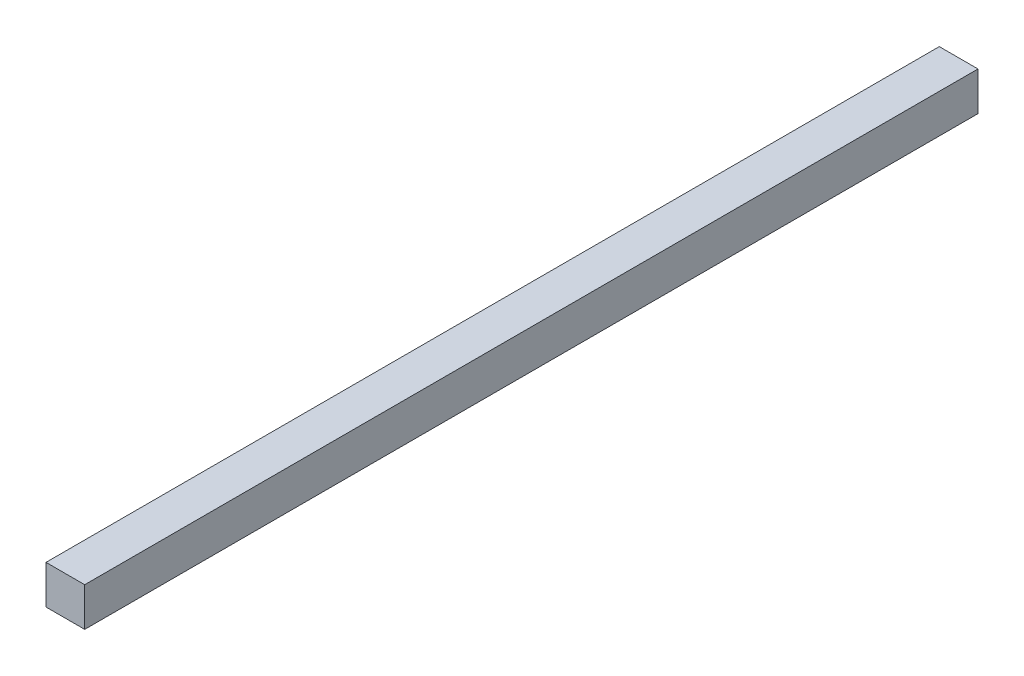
ISO-10303-21;
HEADER;
FILE_DESCRIPTION(('STEP AP214'),'2;1');
FILE_NAME('part.step','',(''),(''),'','','');
FILE_SCHEMA(('AUTOMOTIVE_DESIGN { 1 0 10303 214 1 1 1 1 }'));
ENDSEC;
DATA;
#1=APPLICATION_CONTEXT('core data for automotive mechanical design processes');
#2=APPLICATION_PROTOCOL_DEFINITION('international standard','automotive_design',2000,#1);
#3=PRODUCT_CONTEXT('',#1,'mechanical');
#4=PRODUCT('Part','Part','',(#3));
#5=PRODUCT_RELATED_PRODUCT_CATEGORY('part','',(#4));
#6=PRODUCT_DEFINITION_FORMATION('','',#4);
#7=PRODUCT_DEFINITION_CONTEXT('part definition',#1,'design');
#8=PRODUCT_DEFINITION('design','',#6,#7);
#9=PRODUCT_DEFINITION_SHAPE('','',#8);
#10=(LENGTH_UNIT() NAMED_UNIT(*) SI_UNIT(.MILLI.,.METRE.));
#11=(NAMED_UNIT(*) PLANE_ANGLE_UNIT() SI_UNIT($,.RADIAN.));
#12=(NAMED_UNIT(*) SI_UNIT($,.STERADIAN.) SOLID_ANGLE_UNIT());
#13=UNCERTAINTY_MEASURE_WITH_UNIT(LENGTH_MEASURE(1.E-05),#10,'distance_accuracy_value','');
#14=(GEOMETRIC_REPRESENTATION_CONTEXT(3) GLOBAL_UNCERTAINTY_ASSIGNED_CONTEXT((#13)) GLOBAL_UNIT_ASSIGNED_CONTEXT((#10,
#11,#12)) REPRESENTATION_CONTEXT('',''));
#15=CARTESIAN_POINT('',(0.,0.,0.));
#16=DIRECTION('',(0.,0.,1.));
#17=DIRECTION('',(1.,0.,0.));
#18=AXIS2_PLACEMENT_3D('',#15,#16,#17);
#19=CARTESIAN_POINT('',(-6.5,6.5,150.));
#20=DIRECTION('',(1.,0.,0.));
#21=DIRECTION('',(0.,0.,-1.));
#22=AXIS2_PLACEMENT_3D('',#19,#20,#21);
#23=PLANE('',#22);
#24=DIRECTION('',(0.,-1.,0.));
#25=VECTOR('',#24,1.);
#26=CARTESIAN_POINT('',(-6.5,6.5,-150.));
#27=LINE('',#26,#25);
#28=CARTESIAN_POINT('',(-6.5,6.5,-150.));
#29=VERTEX_POINT('',#28);
#30=CARTESIAN_POINT('',(-6.5,-6.5,-150.));
#31=VERTEX_POINT('',#30);
#32=EDGE_CURVE('E74',#29,#31,#27,.T.);
#33=ORIENTED_EDGE('',*,*,#32,.T.);
#34=DIRECTION('',(0.,0.,-1.));
#35=VECTOR('',#34,1.);
#36=CARTESIAN_POINT('',(-6.5,-6.5,150.));
#37=LINE('',#36,#35);
#38=CARTESIAN_POINT('',(-6.5,-6.5,150.));
#39=VERTEX_POINT('',#38);
#40=EDGE_CURVE('E11',#39,#31,#37,.T.);
#41=ORIENTED_EDGE('',*,*,#40,.F.);
#42=DIRECTION('',(0.,-1.,0.));
#43=VECTOR('',#42,1.);
#44=CARTESIAN_POINT('',(-6.5,6.5,150.));
#45=LINE('',#44,#43);
#46=CARTESIAN_POINT('',(-6.5,6.5,150.));
#47=VERTEX_POINT('',#46);
#48=EDGE_CURVE('E92',#47,#39,#45,.T.);
#49=ORIENTED_EDGE('',*,*,#48,.F.);
#50=DIRECTION('',(0.,0.,-1.));
#51=VECTOR('',#50,1.);
#52=CARTESIAN_POINT('',(-6.5,6.5,150.));
#53=LINE('',#52,#51);
#54=EDGE_CURVE('E86',#47,#29,#53,.T.);
#55=ORIENTED_EDGE('',*,*,#54,.T.);
#56=EDGE_LOOP('',(#33,#41,#49,#55));
#57=FACE_BOUND('',#56,.T.);
#58=ADVANCED_FACE('F30',(#57),#23,.F.);
#59=CARTESIAN_POINT('',(-6.5,-6.5,150.));
#60=DIRECTION('',(0.,1.,0.));
#61=DIRECTION('',(0.,0.,1.));
#62=AXIS2_PLACEMENT_3D('',#59,#60,#61);
#63=PLANE('',#62);
#64=DIRECTION('',(1.,0.,0.));
#65=VECTOR('',#64,1.);
#66=CARTESIAN_POINT('',(-6.5,-6.5,-150.));
#67=LINE('',#66,#65);
#68=CARTESIAN_POINT('',(6.5,-6.5,-150.));
#69=VERTEX_POINT('',#68);
#70=EDGE_CURVE('E70',#31,#69,#67,.T.);
#71=ORIENTED_EDGE('',*,*,#70,.T.);
#72=DIRECTION('',(0.,0.,-1.));
#73=VECTOR('',#72,1.);
#74=CARTESIAN_POINT('',(6.5,-6.5,150.));
#75=LINE('',#74,#73);
#76=CARTESIAN_POINT('',(6.5,-6.5,150.));
#77=VERTEX_POINT('',#76);
#78=EDGE_CURVE('E37',#77,#69,#75,.T.);
#79=ORIENTED_EDGE('',*,*,#78,.F.);
#80=DIRECTION('',(1.,0.,0.));
#81=VECTOR('',#80,1.);
#82=CARTESIAN_POINT('',(-6.5,-6.5,150.));
#83=LINE('',#82,#81);
#84=EDGE_CURVE('E82',#39,#77,#83,.T.);
#85=ORIENTED_EDGE('',*,*,#84,.F.);
#86=ORIENTED_EDGE('',*,*,#40,.T.);
#87=EDGE_LOOP('',(#71,#79,#85,#86));
#88=FACE_BOUND('',#87,.T.);
#89=ADVANCED_FACE('F81',(#88),#63,.F.);
#90=CARTESIAN_POINT('',(6.5,6.5,150.));
#91=DIRECTION('',(-1.,0.,0.));
#92=DIRECTION('',(0.,0.,1.));
#93=AXIS2_PLACEMENT_3D('',#90,#91,#92);
#94=PLANE('',#93);
#95=DIRECTION('',(0.,1.,0.));
#96=VECTOR('',#95,1.);
#97=CARTESIAN_POINT('',(6.5,6.5,-150.));
#98=LINE('',#97,#96);
#99=CARTESIAN_POINT('',(6.5,6.5,-150.));
#100=VERTEX_POINT('',#99);
#101=EDGE_CURVE('E75',#69,#100,#98,.T.);
#102=ORIENTED_EDGE('',*,*,#101,.T.);
#103=DIRECTION('',(0.,0.,-1.));
#104=VECTOR('',#103,1.);
#105=CARTESIAN_POINT('',(6.5,6.5,150.));
#106=LINE('',#105,#104);
#107=CARTESIAN_POINT('',(6.5,6.5,150.));
#108=VERTEX_POINT('',#107);
#109=EDGE_CURVE('E98',#108,#100,#106,.T.);
#110=ORIENTED_EDGE('',*,*,#109,.F.);
#111=DIRECTION('',(0.,1.,0.));
#112=VECTOR('',#111,1.);
#113=CARTESIAN_POINT('',(6.5,6.5,150.));
#114=LINE('',#113,#112);
#115=EDGE_CURVE('E49',#77,#108,#114,.T.);
#116=ORIENTED_EDGE('',*,*,#115,.F.);
#117=ORIENTED_EDGE('',*,*,#78,.T.);
#118=EDGE_LOOP('',(#102,#110,#116,#117));
#119=FACE_BOUND('',#118,.T.);
#120=ADVANCED_FACE('F101',(#119),#94,.F.);
#121=CARTESIAN_POINT('',(-6.5,6.5,150.));
#122=DIRECTION('',(0.,-1.,0.));
#123=DIRECTION('',(0.,0.,-1.));
#124=AXIS2_PLACEMENT_3D('',#121,#122,#123);
#125=PLANE('',#124);
#126=DIRECTION('',(-1.,0.,0.));
#127=VECTOR('',#126,1.);
#128=CARTESIAN_POINT('',(-6.5,6.5,-150.));
#129=LINE('',#128,#127);
#130=EDGE_CURVE('E90',#100,#29,#129,.T.);
#131=ORIENTED_EDGE('',*,*,#130,.T.);
#132=ORIENTED_EDGE('',*,*,#54,.F.);
#133=DIRECTION('',(-1.,0.,0.));
#134=VECTOR('',#133,1.);
#135=CARTESIAN_POINT('',(-6.5,6.5,150.));
#136=LINE('',#135,#134);
#137=EDGE_CURVE('E44',#108,#47,#136,.T.);
#138=ORIENTED_EDGE('',*,*,#137,.F.);
#139=ORIENTED_EDGE('',*,*,#109,.T.);
#140=EDGE_LOOP('',(#131,#132,#138,#139));
#141=FACE_BOUND('',#140,.T.);
#142=ADVANCED_FACE('F103',(#141),#125,.F.);
#143=CARTESIAN_POINT('',(-6.5,-6.5,150.));
#144=DIRECTION('',(0.,0.,1.));
#145=DIRECTION('',(1.,0.,0.));
#146=AXIS2_PLACEMENT_3D('',#143,#144,#145);
#147=PLANE('',#146);
#148=ORIENTED_EDGE('',*,*,#48,.T.);
#149=ORIENTED_EDGE('',*,*,#84,.T.);
#150=ORIENTED_EDGE('',*,*,#115,.T.);
#151=ORIENTED_EDGE('',*,*,#137,.T.);
#152=EDGE_LOOP('',(#148,#149,#150,#151));
#153=FACE_BOUND('',#152,.T.);
#154=ADVANCED_FACE('F104',(#153),#147,.T.);
#155=CARTESIAN_POINT('',(-6.5,-6.5,-150.));
#156=DIRECTION('',(0.,0.,1.));
#157=DIRECTION('',(1.,0.,0.));
#158=AXIS2_PLACEMENT_3D('',#155,#156,#157);
#159=PLANE('',#158);
#160=ORIENTED_EDGE('',*,*,#32,.F.);
#161=ORIENTED_EDGE('',*,*,#130,.F.);
#162=ORIENTED_EDGE('',*,*,#101,.F.);
#163=ORIENTED_EDGE('',*,*,#70,.F.);
#164=EDGE_LOOP('',(#160,#161,#162,#163));
#165=FACE_BOUND('',#164,.T.);
#166=ADVANCED_FACE('F71',(#165),#159,.F.);
#167=CLOSED_SHELL('',(#58,#89,#120,#142,#154,#166));
#168=MANIFOLD_SOLID_BREP('B2',#167);
#169=ADVANCED_BREP_SHAPE_REPRESENTATION('',(#18,#168),#14);
#170=SHAPE_DEFINITION_REPRESENTATION(#9,#169);
ENDSEC;
END-ISO-10303-21;
